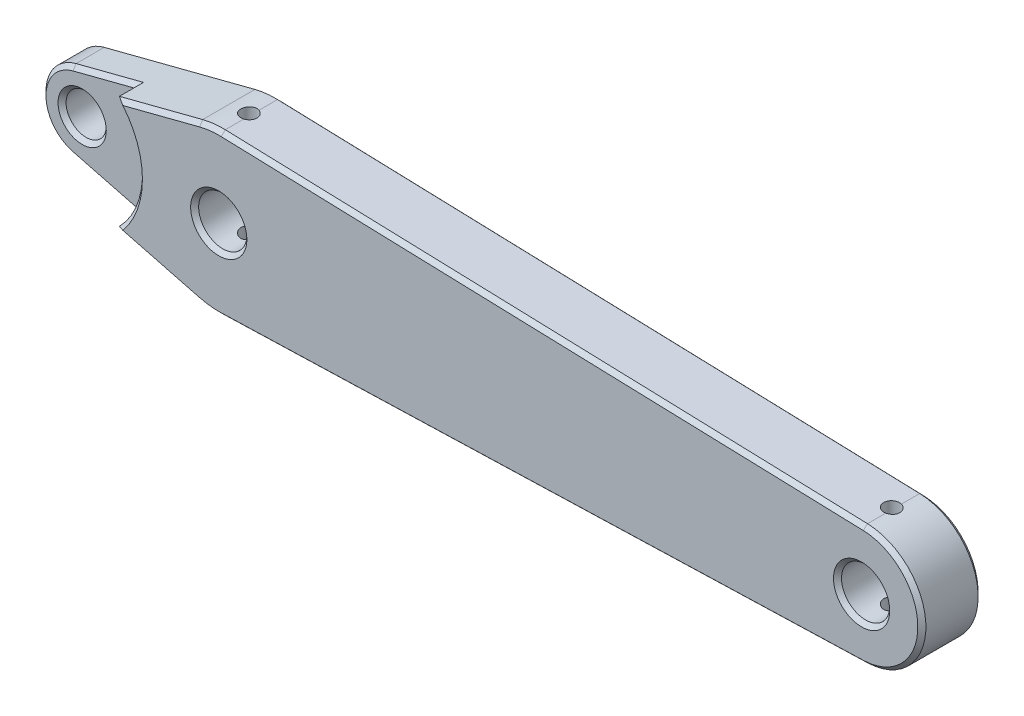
from build123d import *

# Parameters (mm, degrees)
SKETCH_1_R          = 2.5
SKETCH_1_R_2        = 3
EXTRUDE_1_DEPTH     = 3.75
SKETCH_2_R          = 1
CUT_EXTRUDE_1_DEPTH = 20
SKETCH_3_R          = 10
CUT_EXTRUDE_2_DEPTH = 3
CHAMFER_1_SIZE      = 0.5


with BuildPart() as part:
    # Sketch 1 → Extrude 1 (new, symmetric)
    with BuildSketch(Plane.XY):
        with BuildLine():
            Line((-21.25, 4.841229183), (-2.5, 9.682458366))
            ThreePointArc((-2.5, 9.682458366), (-1.104865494, 9.938776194), (0.3125, 9.995115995))
            Line((0.3125, 9.995115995), (80.234375, 7.496336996))
            ThreePointArc((80.234375, 7.496336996), (87.5, 0), (80.234375, -7.496336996))
            Line((80.234375, -7.496336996), (0.3125, -9.995115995))
            ThreePointArc((0.3125, -9.995115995), (-1.104865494, -9.938776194), (-2.5, -9.682458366))
            Line((-2.5, -9.682458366), (-21.25, -4.841229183))
            ThreePointArc((-21.25, -4.841229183), (-25, 0), (-21.25, 4.841229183))
        make_face()
        with Locations((-20, 0)):
            Circle(SKETCH_1_R, mode=Mode.SUBTRACT)
        Circle(SKETCH_1_R_2, mode=Mode.SUBTRACT)
        with Locations((80, 0)):
            Circle(SKETCH_1_R_2, mode=Mode.SUBTRACT)
    extrude(amount=EXTRUDE_1_DEPTH, both=True)

    # Sketch 2 → Cut-Extrude 1 (cut, symmetric)
    with BuildSketch(Plane(origin=(0, 0, 0), x_dir=(1, 0, 0), z_dir=(0, 1, 0))):
        with Locations(Location((0, 0, 0), (0, 0, 270))):
            Circle(SKETCH_2_R)
        with Locations(Location((80, 0, 0), (0, 0, 270))):
            Circle(SKETCH_2_R)
    extrude(amount=CUT_EXTRUDE_1_DEPTH, both=True, mode=Mode.SUBTRACT)

    # Sketch 3 → Cut-Extrude 2 (cut)
    with BuildSketch(Plane.XY.offset(3.75)):
        with Locations((-20, 0)):
            Circle(SKETCH_3_R)
    extrude(amount=-CUT_EXTRUDE_2_DEPTH, mode=Mode.SUBTRACT)

    # Chamfer 1
    chamfer_1_edges = [part.edges().sort_by_distance(p)[0] for p in [
        (-11.875, 7.261843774, -3.75),
        (-1.104865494, 9.938776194, -3.75),
        (-1.104865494, -9.938776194, 3.75),
        (40.2734375, -8.745726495, 3.75),
        (-22.5, 0, -3.75),
        (87.5, 0, 3.75),
        (-3, 0, -3.75),
        (-3, 0, 3.75),
        (40.2734375, 8.745726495, 3.75),
        (77, 0, -3.75),
        (77, 0, 3.75),
        (-1.104865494, 9.938776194, 3.75),
        (-7.682372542, -8.344375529, 3.75),
        (-22.5, 0, 0.75),
        (-10, 0, 3.75),
        (-17.057372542, 5.923760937, 0.75),
        (-25, 0, 0.75),
        (-17.057372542, -5.923760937, 0.75),
        (-7.682372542, 8.344375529, 3.75),
        (40.2734375, 8.745726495, -3.75),
        (87.5, 0, -3.75),
        (40.2734375, -8.745726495, -3.75),
        (-1.104865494, -9.938776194, -3.75),
        (-11.875, -7.261843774, -3.75),
        (-25, 0, -3.75),
    ]]
    chamfer(chamfer_1_edges, length=CHAMFER_1_SIZE)


solid = part.part
